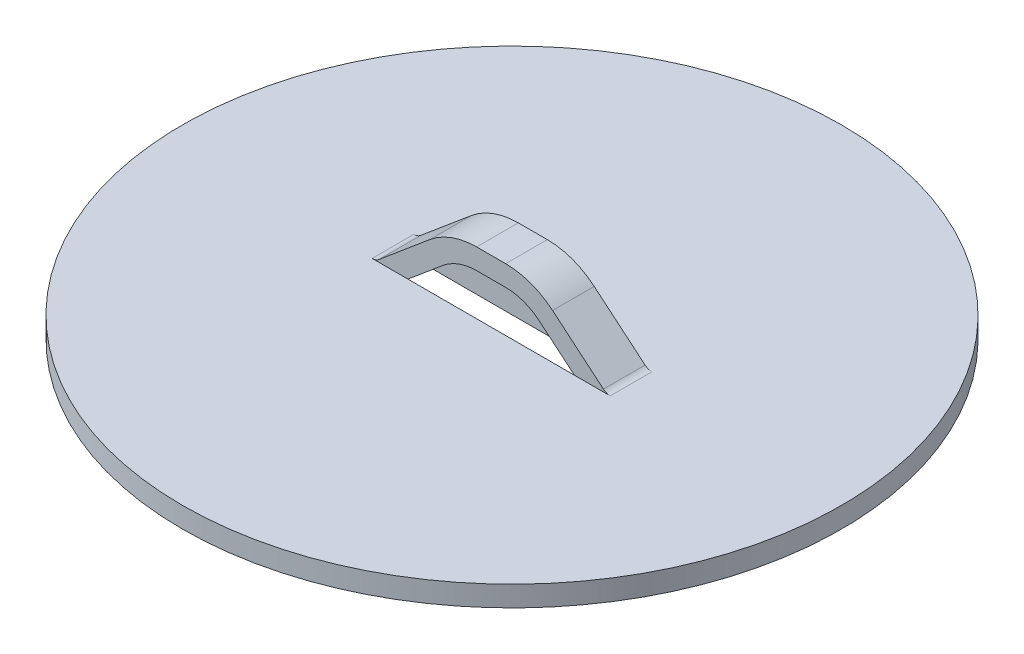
ISO-10303-21;
HEADER;
FILE_DESCRIPTION(('STEP AP214'),'2;1');
FILE_NAME('part.step','',(''),(''),'','','');
FILE_SCHEMA(('AUTOMOTIVE_DESIGN { 1 0 10303 214 1 1 1 1 }'));
ENDSEC;
DATA;
#1=APPLICATION_CONTEXT('core data for automotive mechanical design processes');
#2=APPLICATION_PROTOCOL_DEFINITION('international standard','automotive_design',2000,#1);
#3=PRODUCT_CONTEXT('',#1,'mechanical');
#4=PRODUCT('Part','Part','',(#3));
#5=PRODUCT_RELATED_PRODUCT_CATEGORY('part','',(#4));
#6=PRODUCT_DEFINITION_FORMATION('','',#4);
#7=PRODUCT_DEFINITION_CONTEXT('part definition',#1,'design');
#8=PRODUCT_DEFINITION('design','',#6,#7);
#9=PRODUCT_DEFINITION_SHAPE('','',#8);
#10=(LENGTH_UNIT() NAMED_UNIT(*) SI_UNIT(.MILLI.,.METRE.));
#11=(NAMED_UNIT(*) PLANE_ANGLE_UNIT() SI_UNIT($,.RADIAN.));
#12=(NAMED_UNIT(*) SI_UNIT($,.STERADIAN.) SOLID_ANGLE_UNIT());
#13=UNCERTAINTY_MEASURE_WITH_UNIT(LENGTH_MEASURE(1.E-05),#10,'distance_accuracy_value','');
#14=(GEOMETRIC_REPRESENTATION_CONTEXT(3) GLOBAL_UNCERTAINTY_ASSIGNED_CONTEXT((#13)) GLOBAL_UNIT_ASSIGNED_CONTEXT((#10,
#11,#12)) REPRESENTATION_CONTEXT('',''));
#15=CARTESIAN_POINT('',(0.,0.,0.));
#16=DIRECTION('',(0.,0.,1.));
#17=DIRECTION('',(1.,0.,0.));
#18=AXIS2_PLACEMENT_3D('',#15,#16,#17);
#19=CARTESIAN_POINT('',(-5.73479687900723,0.508,2.0066));
#20=DIRECTION('',(0.,0.,-1.));
#21=DIRECTION('',(-1.,0.,0.));
#22=AXIS2_PLACEMENT_3D('',#19,#20,#21);
#23=PLANE('',#22);
#24=DIRECTION('',(-1.,0.,0.));
#25=VECTOR('',#24,1.);
#26=CARTESIAN_POINT('',(-5.73479687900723,0.,2.0066));
#27=LINE('',#26,#25);
#28=CARTESIAN_POINT('',(-4.00879997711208,0.,2.0066));
#29=VERTEX_POINT('',#28);
#30=CARTESIAN_POINT('',(-5.73479687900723,0.,2.0066));
#31=VERTEX_POINT('',#30);
#32=EDGE_CURVE('E60',#29,#31,#27,.T.);
#33=ORIENTED_EDGE('',*,*,#32,.F.);
#34=DIRECTION('',(0.766044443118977,0.642787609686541,0.));
#35=VECTOR('',#34,1.);
#36=CARTESIAN_POINT('',(-4.77151536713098,-0.639994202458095,2.0066));
#37=LINE('',#36,#35);
#38=CARTESIAN_POINT('',(-2.32136630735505,1.41592496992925,2.0066));
#39=VERTEX_POINT('',#38);
#40=EDGE_CURVE('E267',#29,#39,#37,.T.);
#41=ORIENTED_EDGE('',*,*,#40,.T.);
#42=CARTESIAN_POINT('',(-0.6985,-0.518131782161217,2.0066));
#43=DIRECTION('',(0.,0.,-1.));
#44=DIRECTION('',(-1.,0.,0.));
#45=AXIS2_PLACEMENT_3D('',#42,#43,#44);
#46=CIRCLE('',#45,2.52473178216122);
#47=CARTESIAN_POINT('',(-0.6985,2.0066,2.0066));
#48=VERTEX_POINT('',#47);
#49=EDGE_CURVE('E270',#39,#48,#46,.T.);
#50=ORIENTED_EDGE('',*,*,#49,.T.);
#51=DIRECTION('',(1.,0.,0.));
#52=VECTOR('',#51,1.);
#53=CARTESIAN_POINT('',(-0.6985,2.0066,2.0066));
#54=LINE('',#53,#52);
#55=CARTESIAN_POINT('',(0.6985,2.0066,2.0066));
#56=VERTEX_POINT('',#55);
#57=EDGE_CURVE('E272',#48,#56,#54,.T.);
#58=ORIENTED_EDGE('',*,*,#57,.T.);
#59=CARTESIAN_POINT('',(0.6985,-0.518131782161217,2.0066));
#60=DIRECTION('',(0.,0.,-1.));
#61=DIRECTION('',(-1.,0.,0.));
#62=AXIS2_PLACEMENT_3D('',#59,#60,#61);
#63=CIRCLE('',#62,2.52473178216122);
#64=CARTESIAN_POINT('',(2.32136630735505,1.41592496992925,2.0066));
#65=VERTEX_POINT('',#64);
#66=EDGE_CURVE('E274',#56,#65,#63,.T.);
#67=ORIENTED_EDGE('',*,*,#66,.T.);
#68=DIRECTION('',(0.766044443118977,-0.642787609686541,0.));
#69=VECTOR('',#68,1.);
#70=CARTESIAN_POINT('',(2.32136630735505,1.41592496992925,2.0066));
#71=LINE('',#70,#69);
#72=CARTESIAN_POINT('',(4.00879997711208,0.,2.0066));
#73=VERTEX_POINT('',#72);
#74=EDGE_CURVE('E276',#65,#73,#71,.T.);
#75=ORIENTED_EDGE('',*,*,#74,.T.);
#76=CARTESIAN_POINT('',(5.73479687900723,0.,2.0066));
#77=VERTEX_POINT('',#76);
#78=EDGE_CURVE('E265',#77,#73,#27,.T.);
#79=ORIENTED_EDGE('',*,*,#78,.F.);
#80=CARTESIAN_POINT('',(5.73479687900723,0.508,2.0066));
#81=DIRECTION('',(0.,0.,-1.));
#82=DIRECTION('',(1.,0.,0.));
#83=AXIS2_PLACEMENT_3D('',#80,#81,#82);
#84=CIRCLE('',#83,0.508);
#85=CARTESIAN_POINT('',(5.40826077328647,0.118849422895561,2.0066));
#86=VERTEX_POINT('',#85);
#87=EDGE_CURVE('E279',#77,#86,#84,.T.);
#88=ORIENTED_EDGE('',*,*,#87,.T.);
#89=DIRECTION('',(-0.766044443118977,0.642787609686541,0.));
#90=VECTOR('',#89,1.);
#91=CARTESIAN_POINT('',(2.95811171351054,2.17476859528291,2.0066));
#92=LINE('',#91,#90);
#93=CARTESIAN_POINT('',(2.95811171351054,2.17476859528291,2.0066));
#94=VERTEX_POINT('',#93);
#95=EDGE_CURVE('E281',#86,#94,#92,.T.);
#96=ORIENTED_EDGE('',*,*,#95,.T.);
#97=CARTESIAN_POINT('',(0.6985,-0.518131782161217,2.0066));
#98=DIRECTION('',(0.,0.,1.));
#99=DIRECTION('',(-1.,0.,0.));
#100=AXIS2_PLACEMENT_3D('',#97,#98,#99);
#101=CIRCLE('',#100,3.51533178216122);
#102=CARTESIAN_POINT('',(0.6985,2.9972,2.0066));
#103=VERTEX_POINT('',#102);
#104=EDGE_CURVE('E283',#94,#103,#101,.T.);
#105=ORIENTED_EDGE('',*,*,#104,.T.);
#106=DIRECTION('',(-1.,0.,0.));
#107=VECTOR('',#106,1.);
#108=CARTESIAN_POINT('',(-0.6985,2.9972,2.0066));
#109=LINE('',#108,#107);
#110=CARTESIAN_POINT('',(-0.6985,2.9972,2.0066));
#111=VERTEX_POINT('',#110);
#112=EDGE_CURVE('E285',#103,#111,#109,.T.);
#113=ORIENTED_EDGE('',*,*,#112,.T.);
#114=CARTESIAN_POINT('',(-0.6985,-0.518131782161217,2.0066));
#115=DIRECTION('',(0.,0.,1.));
#116=DIRECTION('',(-1.,0.,0.));
#117=AXIS2_PLACEMENT_3D('',#114,#115,#116);
#118=CIRCLE('',#117,3.51533178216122);
#119=CARTESIAN_POINT('',(-2.95811171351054,2.17476859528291,2.0066));
#120=VERTEX_POINT('',#119);
#121=EDGE_CURVE('E287',#111,#120,#118,.T.);
#122=ORIENTED_EDGE('',*,*,#121,.T.);
#123=DIRECTION('',(-0.766044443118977,-0.642787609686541,0.));
#124=VECTOR('',#123,1.);
#125=CARTESIAN_POINT('',(-5.40826077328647,0.118849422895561,2.0066));
#126=LINE('',#125,#124);
#127=CARTESIAN_POINT('',(-5.40826077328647,0.118849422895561,2.0066));
#128=VERTEX_POINT('',#127);
#129=EDGE_CURVE('E195',#120,#128,#126,.T.);
#130=ORIENTED_EDGE('',*,*,#129,.T.);
#131=CARTESIAN_POINT('',(-5.73479687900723,0.508,2.0066));
#132=DIRECTION('',(0.,0.,-1.));
#133=DIRECTION('',(-1.,0.,0.));
#134=AXIS2_PLACEMENT_3D('',#131,#132,#133);
#135=CIRCLE('',#134,0.508);
#136=EDGE_CURVE('E191',#128,#31,#135,.T.);
#137=ORIENTED_EDGE('',*,*,#136,.T.);
#138=EDGE_LOOP('',(#33,#41,#50,#58,#67,#75,#79,#88,#96,#105,#113,#122,#130,#137));
#139=FACE_BOUND('',#138,.T.);
#140=ADVANCED_FACE('F37',(#139),#23,.F.);
#141=CARTESIAN_POINT('',(-5.73479687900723,0.508,0.));
#142=DIRECTION('',(0.,0.,-1.));
#143=DIRECTION('',(-1.,0.,0.));
#144=AXIS2_PLACEMENT_3D('',#141,#142,#143);
#145=PLANE('',#144);
#146=DIRECTION('',(0.766044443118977,0.642787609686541,0.));
#147=VECTOR('',#146,1.);
#148=CARTESIAN_POINT('',(-4.77151536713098,-0.639994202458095,0.));
#149=LINE('',#148,#147);
#150=CARTESIAN_POINT('',(-4.00879997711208,0.,0.));
#151=VERTEX_POINT('',#150);
#152=CARTESIAN_POINT('',(-2.32136630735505,1.41592496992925,0.));
#153=VERTEX_POINT('',#152);
#154=EDGE_CURVE('E170',#151,#153,#149,.T.);
#155=ORIENTED_EDGE('',*,*,#154,.F.);
#156=DIRECTION('',(1.,0.,0.));
#157=VECTOR('',#156,1.);
#158=CARTESIAN_POINT('',(-5.73479687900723,0.,0.));
#159=LINE('',#158,#157);
#160=CARTESIAN_POINT('',(-5.73479687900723,0.,0.));
#161=VERTEX_POINT('',#160);
#162=EDGE_CURVE('E164',#161,#151,#159,.T.);
#163=ORIENTED_EDGE('',*,*,#162,.F.);
#164=CARTESIAN_POINT('',(-5.73479687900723,0.508,0.));
#165=DIRECTION('',(0.,0.,-1.));
#166=DIRECTION('',(-1.,0.,0.));
#167=AXIS2_PLACEMENT_3D('',#164,#165,#166);
#168=CIRCLE('',#167,0.508);
#169=CARTESIAN_POINT('',(-5.40826077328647,0.118849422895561,0.));
#170=VERTEX_POINT('',#169);
#171=EDGE_CURVE('E168',#170,#161,#168,.T.);
#172=ORIENTED_EDGE('',*,*,#171,.F.);
#173=DIRECTION('',(-0.766044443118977,-0.642787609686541,0.));
#174=VECTOR('',#173,1.);
#175=CARTESIAN_POINT('',(-5.40826077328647,0.118849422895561,0.));
#176=LINE('',#175,#174);
#177=CARTESIAN_POINT('',(-2.95811171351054,2.17476859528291,0.));
#178=VERTEX_POINT('',#177);
#179=EDGE_CURVE('E186',#178,#170,#176,.T.);
#180=ORIENTED_EDGE('',*,*,#179,.F.);
#181=CARTESIAN_POINT('',(-0.6985,-0.518131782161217,0.));
#182=DIRECTION('',(0.,0.,1.));
#183=DIRECTION('',(-1.,0.,0.));
#184=AXIS2_PLACEMENT_3D('',#181,#182,#183);
#185=CIRCLE('',#184,3.51533178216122);
#186=CARTESIAN_POINT('',(-0.6985,2.9972,0.));
#187=VERTEX_POINT('',#186);
#188=EDGE_CURVE('E314',#187,#178,#185,.T.);
#189=ORIENTED_EDGE('',*,*,#188,.F.);
#190=DIRECTION('',(-1.,0.,0.));
#191=VECTOR('',#190,1.);
#192=CARTESIAN_POINT('',(-0.6985,2.9972,0.));
#193=LINE('',#192,#191);
#194=CARTESIAN_POINT('',(0.6985,2.9972,0.));
#195=VERTEX_POINT('',#194);
#196=EDGE_CURVE('E312',#195,#187,#193,.T.);
#197=ORIENTED_EDGE('',*,*,#196,.F.);
#198=CARTESIAN_POINT('',(0.6985,-0.518131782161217,0.));
#199=DIRECTION('',(0.,0.,1.));
#200=DIRECTION('',(-1.,0.,0.));
#201=AXIS2_PLACEMENT_3D('',#198,#199,#200);
#202=CIRCLE('',#201,3.51533178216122);
#203=CARTESIAN_POINT('',(2.95811171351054,2.17476859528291,0.));
#204=VERTEX_POINT('',#203);
#205=EDGE_CURVE('E310',#204,#195,#202,.T.);
#206=ORIENTED_EDGE('',*,*,#205,.F.);
#207=DIRECTION('',(-0.766044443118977,0.642787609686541,0.));
#208=VECTOR('',#207,1.);
#209=CARTESIAN_POINT('',(2.95811171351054,2.17476859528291,0.));
#210=LINE('',#209,#208);
#211=CARTESIAN_POINT('',(5.40826077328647,0.118849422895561,0.));
#212=VERTEX_POINT('',#211);
#213=EDGE_CURVE('E308',#212,#204,#210,.T.);
#214=ORIENTED_EDGE('',*,*,#213,.F.);
#215=CARTESIAN_POINT('',(5.73479687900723,0.508,0.));
#216=DIRECTION('',(0.,0.,-1.));
#217=DIRECTION('',(1.,0.,0.));
#218=AXIS2_PLACEMENT_3D('',#215,#216,#217);
#219=CIRCLE('',#218,0.508);
#220=CARTESIAN_POINT('',(5.73479687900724,0.,0.));
#221=VERTEX_POINT('',#220);
#222=EDGE_CURVE('E306',#221,#212,#219,.T.);
#223=ORIENTED_EDGE('',*,*,#222,.F.);
#224=DIRECTION('',(-1.,0.,0.));
#225=VECTOR('',#224,1.);
#226=CARTESIAN_POINT('',(-5.73479687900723,0.,0.));
#227=LINE('',#226,#225);
#228=CARTESIAN_POINT('',(4.00879997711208,0.,0.));
#229=VERTEX_POINT('',#228);
#230=EDGE_CURVE('E11',#221,#229,#227,.T.);
#231=ORIENTED_EDGE('',*,*,#230,.T.);
#232=DIRECTION('',(0.766044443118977,-0.642787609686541,0.));
#233=VECTOR('',#232,1.);
#234=CARTESIAN_POINT('',(2.32136630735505,1.41592496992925,0.));
#235=LINE('',#234,#233);
#236=CARTESIAN_POINT('',(2.32136630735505,1.41592496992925,0.));
#237=VERTEX_POINT('',#236);
#238=EDGE_CURVE('E300',#237,#229,#235,.T.);
#239=ORIENTED_EDGE('',*,*,#238,.F.);
#240=CARTESIAN_POINT('',(0.6985,-0.518131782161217,0.));
#241=DIRECTION('',(0.,0.,-1.));
#242=DIRECTION('',(-1.,0.,0.));
#243=AXIS2_PLACEMENT_3D('',#240,#241,#242);
#244=CIRCLE('',#243,2.52473178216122);
#245=CARTESIAN_POINT('',(0.6985,2.0066,0.));
#246=VERTEX_POINT('',#245);
#247=EDGE_CURVE('E297',#246,#237,#244,.T.);
#248=ORIENTED_EDGE('',*,*,#247,.F.);
#249=DIRECTION('',(1.,0.,0.));
#250=VECTOR('',#249,1.);
#251=CARTESIAN_POINT('',(-0.6985,2.0066,0.));
#252=LINE('',#251,#250);
#253=CARTESIAN_POINT('',(-0.6985,2.0066,0.));
#254=VERTEX_POINT('',#253);
#255=EDGE_CURVE('E295',#254,#246,#252,.T.);
#256=ORIENTED_EDGE('',*,*,#255,.F.);
#257=CARTESIAN_POINT('',(-0.6985,-0.518131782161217,0.));
#258=DIRECTION('',(0.,0.,-1.));
#259=DIRECTION('',(-1.,0.,0.));
#260=AXIS2_PLACEMENT_3D('',#257,#258,#259);
#261=CIRCLE('',#260,2.52473178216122);
#262=EDGE_CURVE('E293',#153,#254,#261,.T.);
#263=ORIENTED_EDGE('',*,*,#262,.F.);
#264=EDGE_LOOP('',(#155,#163,#172,#180,#189,#197,#206,#214,#223,#231,#239,#248,#256,#263));
#265=FACE_BOUND('',#264,.T.);
#266=ADVANCED_FACE('F166',(#265),#145,.T.);
#267=CARTESIAN_POINT('',(-5.73479687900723,0.508,2.0066));
#268=DIRECTION('',(0.,0.,-1.));
#269=DIRECTION('',(-1.,0.,0.));
#270=AXIS2_PLACEMENT_3D('',#267,#268,#269);
#271=CYLINDRICAL_SURFACE('',#270,1.4986);
#272=CARTESIAN_POINT('',(-5.73479687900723,0.508,0.));
#273=DIRECTION('',(0.,0.,1.));
#274=DIRECTION('',(-1.,0.,0.));
#275=AXIS2_PLACEMENT_3D('',#272,#273,#274);
#276=CIRCLE('',#275,1.4986);
#277=CARTESIAN_POINT('',(-5.73479687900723,-0.9906,0.));
#278=VERTEX_POINT('',#277);
#279=CARTESIAN_POINT('',(-4.77151536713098,-0.639994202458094,0.));
#280=VERTEX_POINT('',#279);
#281=EDGE_CURVE('E241',#278,#280,#276,.T.);
#282=ORIENTED_EDGE('',*,*,#281,.T.);
#283=DIRECTION('',(0.,0.,-1.));
#284=VECTOR('',#283,1.);
#285=CARTESIAN_POINT('',(-4.77151536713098,-0.639994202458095,2.0066));
#286=LINE('',#285,#284);
#287=CARTESIAN_POINT('',(-4.77151536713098,-0.639994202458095,2.0066));
#288=VERTEX_POINT('',#287);
#289=EDGE_CURVE('E234',#288,#280,#286,.T.);
#290=ORIENTED_EDGE('',*,*,#289,.F.);
#291=CARTESIAN_POINT('',(-5.73479687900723,0.508,2.0066));
#292=DIRECTION('',(0.,0.,1.));
#293=DIRECTION('',(-1.,0.,0.));
#294=AXIS2_PLACEMENT_3D('',#291,#292,#293);
#295=CIRCLE('',#294,1.4986);
#296=CARTESIAN_POINT('',(-5.73479687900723,-0.9906,2.0066));
#297=VERTEX_POINT('',#296);
#298=EDGE_CURVE('E185',#297,#288,#295,.T.);
#299=ORIENTED_EDGE('',*,*,#298,.F.);
#300=DIRECTION('',(0.,0.,-1.));
#301=VECTOR('',#300,1.);
#302=CARTESIAN_POINT('',(-5.73479687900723,-0.9906,2.0066));
#303=LINE('',#302,#301);
#304=EDGE_CURVE('E45',#297,#278,#303,.T.);
#305=ORIENTED_EDGE('',*,*,#304,.T.);
#306=EDGE_LOOP('',(#282,#290,#299,#305));
#307=FACE_BOUND('',#306,.T.);
#308=ADVANCED_FACE('F39',(#307),#271,.T.);
#309=CARTESIAN_POINT('',(-4.77151536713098,-0.639994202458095,2.0066));
#310=DIRECTION('',(-0.642787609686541,0.766044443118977,0.));
#311=DIRECTION('',(-0.766044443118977,-0.642787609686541,0.));
#312=AXIS2_PLACEMENT_3D('',#309,#310,#311);
#313=PLANE('',#312);
#314=EDGE_CURVE('E291',#280,#151,#149,.T.);
#315=ORIENTED_EDGE('',*,*,#314,.T.);
#316=ORIENTED_EDGE('',*,*,#154,.T.);
#317=DIRECTION('',(0.,0.,-1.));
#318=VECTOR('',#317,1.);
#319=CARTESIAN_POINT('',(-2.32136630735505,1.41592496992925,2.0066));
#320=LINE('',#319,#318);
#321=EDGE_CURVE('E231',#39,#153,#320,.T.);
#322=ORIENTED_EDGE('',*,*,#321,.F.);
#323=ORIENTED_EDGE('',*,*,#40,.F.);
#324=EDGE_CURVE('E268',#288,#29,#37,.T.);
#325=ORIENTED_EDGE('',*,*,#324,.F.);
#326=ORIENTED_EDGE('',*,*,#289,.T.);
#327=EDGE_LOOP('',(#315,#316,#322,#323,#325,#326));
#328=FACE_BOUND('',#327,.T.);
#329=ADVANCED_FACE('F363',(#328),#313,.F.);
#330=CARTESIAN_POINT('',(-0.6985,-0.518131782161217,2.0066));
#331=DIRECTION('',(0.,0.,-1.));
#332=DIRECTION('',(-1.,0.,0.));
#333=AXIS2_PLACEMENT_3D('',#330,#331,#332);
#334=CYLINDRICAL_SURFACE('',#333,2.52473178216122);
#335=ORIENTED_EDGE('',*,*,#262,.T.);
#336=DIRECTION('',(0.,0.,-1.));
#337=VECTOR('',#336,1.);
#338=CARTESIAN_POINT('',(-0.6985,2.0066,2.0066));
#339=LINE('',#338,#337);
#340=EDGE_CURVE('E228',#48,#254,#339,.T.);
#341=ORIENTED_EDGE('',*,*,#340,.F.);
#342=ORIENTED_EDGE('',*,*,#49,.F.);
#343=ORIENTED_EDGE('',*,*,#321,.T.);
#344=EDGE_LOOP('',(#335,#341,#342,#343));
#345=FACE_BOUND('',#344,.T.);
#346=ADVANCED_FACE('F360',(#345),#334,.F.);
#347=CARTESIAN_POINT('',(-0.6985,2.0066,2.0066));
#348=DIRECTION('',(0.,1.,0.));
#349=DIRECTION('',(0.,0.,1.));
#350=AXIS2_PLACEMENT_3D('',#347,#348,#349);
#351=PLANE('',#350);
#352=ORIENTED_EDGE('',*,*,#255,.T.);
#353=DIRECTION('',(0.,0.,-1.));
#354=VECTOR('',#353,1.);
#355=CARTESIAN_POINT('',(0.6985,2.0066,2.0066));
#356=LINE('',#355,#354);
#357=EDGE_CURVE('E225',#56,#246,#356,.T.);
#358=ORIENTED_EDGE('',*,*,#357,.F.);
#359=ORIENTED_EDGE('',*,*,#57,.F.);
#360=ORIENTED_EDGE('',*,*,#340,.T.);
#361=EDGE_LOOP('',(#352,#358,#359,#360));
#362=FACE_BOUND('',#361,.T.);
#363=ADVANCED_FACE('F355',(#362),#351,.F.);
#364=CARTESIAN_POINT('',(0.6985,-0.518131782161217,2.0066));
#365=DIRECTION('',(0.,0.,-1.));
#366=DIRECTION('',(-1.,0.,0.));
#367=AXIS2_PLACEMENT_3D('',#364,#365,#366);
#368=CYLINDRICAL_SURFACE('',#367,2.52473178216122);
#369=ORIENTED_EDGE('',*,*,#247,.T.);
#370=DIRECTION('',(0.,0.,-1.));
#371=VECTOR('',#370,1.);
#372=CARTESIAN_POINT('',(2.32136630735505,1.41592496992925,2.0066));
#373=LINE('',#372,#371);
#374=EDGE_CURVE('E222',#65,#237,#373,.T.);
#375=ORIENTED_EDGE('',*,*,#374,.F.);
#376=ORIENTED_EDGE('',*,*,#66,.F.);
#377=ORIENTED_EDGE('',*,*,#357,.T.);
#378=EDGE_LOOP('',(#369,#375,#376,#377));
#379=FACE_BOUND('',#378,.T.);
#380=ADVANCED_FACE('F351',(#379),#368,.F.);
#381=CARTESIAN_POINT('',(2.32136630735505,1.41592496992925,2.0066));
#382=DIRECTION('',(0.642787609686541,0.766044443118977,0.));
#383=DIRECTION('',(-0.766044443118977,0.642787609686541,0.));
#384=AXIS2_PLACEMENT_3D('',#381,#382,#383);
#385=PLANE('',#384);
#386=ORIENTED_EDGE('',*,*,#238,.T.);
#387=CARTESIAN_POINT('',(4.77151536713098,-0.639994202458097,0.));
#388=VERTEX_POINT('',#387);
#389=EDGE_CURVE('E299',#229,#388,#235,.T.);
#390=ORIENTED_EDGE('',*,*,#389,.T.);
#391=DIRECTION('',(0.,0.,-1.));
#392=VECTOR('',#391,1.);
#393=CARTESIAN_POINT('',(4.77151536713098,-0.639994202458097,2.0066));
#394=LINE('',#393,#392);
#395=CARTESIAN_POINT('',(4.77151536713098,-0.639994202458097,2.0066));
#396=VERTEX_POINT('',#395);
#397=EDGE_CURVE('E219',#396,#388,#394,.T.);
#398=ORIENTED_EDGE('',*,*,#397,.F.);
#399=EDGE_CURVE('E52',#73,#396,#71,.T.);
#400=ORIENTED_EDGE('',*,*,#399,.F.);
#401=ORIENTED_EDGE('',*,*,#74,.F.);
#402=ORIENTED_EDGE('',*,*,#374,.T.);
#403=EDGE_LOOP('',(#386,#390,#398,#400,#401,#402));
#404=FACE_BOUND('',#403,.T.);
#405=ADVANCED_FACE('F347',(#404),#385,.F.);
#406=CARTESIAN_POINT('',(5.73479687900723,0.508,2.0066));
#407=DIRECTION('',(0.,0.,-1.));
#408=DIRECTION('',(-1.,0.,0.));
#409=AXIS2_PLACEMENT_3D('',#406,#407,#408);
#410=CYLINDRICAL_SURFACE('',#409,1.4986);
#411=CARTESIAN_POINT('',(5.73479687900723,0.508,0.));
#412=DIRECTION('',(0.,0.,1.));
#413=DIRECTION('',(1.,0.,0.));
#414=AXIS2_PLACEMENT_3D('',#411,#412,#413);
#415=CIRCLE('',#414,1.4986);
#416=CARTESIAN_POINT('',(5.73479687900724,-0.9906,0.));
#417=VERTEX_POINT('',#416);
#418=EDGE_CURVE('E303',#388,#417,#415,.T.);
#419=ORIENTED_EDGE('',*,*,#418,.T.);
#420=DIRECTION('',(0.,0.,-1.));
#421=VECTOR('',#420,1.);
#422=CARTESIAN_POINT('',(5.73479687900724,-0.9906,2.0066));
#423=LINE('',#422,#421);
#424=CARTESIAN_POINT('',(5.73479687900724,-0.9906,2.0066));
#425=VERTEX_POINT('',#424);
#426=EDGE_CURVE('E216',#425,#417,#423,.T.);
#427=ORIENTED_EDGE('',*,*,#426,.F.);
#428=CARTESIAN_POINT('',(5.73479687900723,0.508,2.0066));
#429=DIRECTION('',(0.,0.,1.));
#430=DIRECTION('',(1.,0.,0.));
#431=AXIS2_PLACEMENT_3D('',#428,#429,#430);
#432=CIRCLE('',#431,1.4986);
#433=EDGE_CURVE('E254',#396,#425,#432,.T.);
#434=ORIENTED_EDGE('',*,*,#433,.F.);
#435=ORIENTED_EDGE('',*,*,#397,.T.);
#436=EDGE_LOOP('',(#419,#427,#434,#435));
#437=FACE_BOUND('',#436,.T.);
#438=ADVANCED_FACE('F368',(#437),#410,.T.);
#439=CARTESIAN_POINT('',(5.73479687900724,-0.9906,2.0066));
#440=DIRECTION('',(0.,1.,0.));
#441=DIRECTION('',(0.,0.,1.));
#442=AXIS2_PLACEMENT_3D('',#439,#440,#441);
#443=PLANE('',#442);
#444=CARTESIAN_POINT('',(0.,-0.9906,1.0033));
#445=DIRECTION('',(0.,-1.,0.));
#446=DIRECTION('',(0.,0.,-1.));
#447=AXIS2_PLACEMENT_3D('',#444,#445,#446);
#448=CIRCLE('',#447,15.875);
#449=CARTESIAN_POINT('',(0.,-0.9906,-14.8717));
#450=VERTEX_POINT('',#449);
#451=EDGE_CURVE('E262',#450,#450,#448,.T.);
#452=ORIENTED_EDGE('',*,*,#451,.T.);
#453=EDGE_LOOP('',(#452));
#454=FACE_BOUND('',#453,.T.);
#455=DIRECTION('',(-1.,0.,0.));
#456=VECTOR('',#455,1.);
#457=CARTESIAN_POINT('',(-5.73479687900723,-0.9906,2.0066));
#458=LINE('',#457,#456);
#459=EDGE_CURVE('E247',#425,#297,#458,.T.);
#460=ORIENTED_EDGE('',*,*,#459,.F.);
#461=ORIENTED_EDGE('',*,*,#426,.T.);
#462=DIRECTION('',(1.,0.,0.));
#463=VECTOR('',#462,1.);
#464=CARTESIAN_POINT('',(-5.73479687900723,-0.9906,0.));
#465=LINE('',#464,#463);
#466=EDGE_CURVE('E248',#278,#417,#465,.T.);
#467=ORIENTED_EDGE('',*,*,#466,.F.);
#468=ORIENTED_EDGE('',*,*,#304,.F.);
#469=EDGE_LOOP('',(#460,#461,#467,#468));
#470=FACE_BOUND('',#469,.T.);
#471=ADVANCED_FACE('F246',(#454,#470),#443,.F.);
#472=CARTESIAN_POINT('',(5.73479687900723,0.508,2.0066));
#473=DIRECTION('',(0.,0.,-1.));
#474=DIRECTION('',(-1.,0.,0.));
#475=AXIS2_PLACEMENT_3D('',#472,#473,#474);
#476=CYLINDRICAL_SURFACE('',#475,0.508);
#477=ORIENTED_EDGE('',*,*,#222,.T.);
#478=DIRECTION('',(0.,0.,-1.));
#479=VECTOR('',#478,1.);
#480=CARTESIAN_POINT('',(5.40826077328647,0.118849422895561,2.0066));
#481=LINE('',#480,#479);
#482=EDGE_CURVE('E210',#86,#212,#481,.T.);
#483=ORIENTED_EDGE('',*,*,#482,.F.);
#484=ORIENTED_EDGE('',*,*,#87,.F.);
#485=DIRECTION('',(0.,0.,-1.));
#486=VECTOR('',#485,1.);
#487=CARTESIAN_POINT('',(5.73479687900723,0.,2.0066));
#488=LINE('',#487,#486);
#489=EDGE_CURVE('E213',#77,#221,#488,.T.);
#490=ORIENTED_EDGE('',*,*,#489,.T.);
#491=EDGE_LOOP('',(#477,#483,#484,#490));
#492=FACE_BOUND('',#491,.T.);
#493=ADVANCED_FACE('F342',(#492),#476,.F.);
#494=CARTESIAN_POINT('',(2.95811171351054,2.17476859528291,2.0066));
#495=DIRECTION('',(-0.642787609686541,-0.766044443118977,0.));
#496=DIRECTION('',(0.766044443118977,-0.642787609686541,0.));
#497=AXIS2_PLACEMENT_3D('',#494,#495,#496);
#498=PLANE('',#497);
#499=ORIENTED_EDGE('',*,*,#213,.T.);
#500=DIRECTION('',(0.,0.,-1.));
#501=VECTOR('',#500,1.);
#502=CARTESIAN_POINT('',(2.95811171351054,2.17476859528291,2.0066));
#503=LINE('',#502,#501);
#504=EDGE_CURVE('E207',#94,#204,#503,.T.);
#505=ORIENTED_EDGE('',*,*,#504,.F.);
#506=ORIENTED_EDGE('',*,*,#95,.F.);
#507=ORIENTED_EDGE('',*,*,#482,.T.);
#508=EDGE_LOOP('',(#499,#505,#506,#507));
#509=FACE_BOUND('',#508,.T.);
#510=ADVANCED_FACE('F337',(#509),#498,.F.);
#511=CARTESIAN_POINT('',(0.6985,-0.518131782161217,2.0066));
#512=DIRECTION('',(0.,0.,-1.));
#513=DIRECTION('',(-1.,0.,0.));
#514=AXIS2_PLACEMENT_3D('',#511,#512,#513);
#515=CYLINDRICAL_SURFACE('',#514,3.51533178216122);
#516=ORIENTED_EDGE('',*,*,#205,.T.);
#517=DIRECTION('',(0.,0.,-1.));
#518=VECTOR('',#517,1.);
#519=CARTESIAN_POINT('',(0.6985,2.9972,2.0066));
#520=LINE('',#519,#518);
#521=EDGE_CURVE('E204',#103,#195,#520,.T.);
#522=ORIENTED_EDGE('',*,*,#521,.F.);
#523=ORIENTED_EDGE('',*,*,#104,.F.);
#524=ORIENTED_EDGE('',*,*,#504,.T.);
#525=EDGE_LOOP('',(#516,#522,#523,#524));
#526=FACE_BOUND('',#525,.T.);
#527=ADVANCED_FACE('F332',(#526),#515,.T.);
#528=CARTESIAN_POINT('',(-0.6985,2.9972,2.0066));
#529=DIRECTION('',(0.,-1.,0.));
#530=DIRECTION('',(0.,0.,-1.));
#531=AXIS2_PLACEMENT_3D('',#528,#529,#530);
#532=PLANE('',#531);
#533=ORIENTED_EDGE('',*,*,#196,.T.);
#534=DIRECTION('',(0.,0.,-1.));
#535=VECTOR('',#534,1.);
#536=CARTESIAN_POINT('',(-0.6985,2.9972,2.0066));
#537=LINE('',#536,#535);
#538=EDGE_CURVE('E201',#111,#187,#537,.T.);
#539=ORIENTED_EDGE('',*,*,#538,.F.);
#540=ORIENTED_EDGE('',*,*,#112,.F.);
#541=ORIENTED_EDGE('',*,*,#521,.T.);
#542=EDGE_LOOP('',(#533,#539,#540,#541));
#543=FACE_BOUND('',#542,.T.);
#544=ADVANCED_FACE('F328',(#543),#532,.F.);
#545=CARTESIAN_POINT('',(-0.6985,-0.518131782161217,2.0066));
#546=DIRECTION('',(0.,0.,-1.));
#547=DIRECTION('',(-1.,0.,0.));
#548=AXIS2_PLACEMENT_3D('',#545,#546,#547);
#549=CYLINDRICAL_SURFACE('',#548,3.51533178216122);
#550=ORIENTED_EDGE('',*,*,#188,.T.);
#551=DIRECTION('',(0.,0.,-1.));
#552=VECTOR('',#551,1.);
#553=CARTESIAN_POINT('',(-2.95811171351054,2.17476859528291,2.0066));
#554=LINE('',#553,#552);
#555=EDGE_CURVE('E193',#120,#178,#554,.T.);
#556=ORIENTED_EDGE('',*,*,#555,.F.);
#557=ORIENTED_EDGE('',*,*,#121,.F.);
#558=ORIENTED_EDGE('',*,*,#538,.T.);
#559=EDGE_LOOP('',(#550,#556,#557,#558));
#560=FACE_BOUND('',#559,.T.);
#561=ADVANCED_FACE('F323',(#560),#549,.T.);
#562=CARTESIAN_POINT('',(-5.40826077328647,0.118849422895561,2.0066));
#563=DIRECTION('',(0.642787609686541,-0.766044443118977,0.));
#564=DIRECTION('',(0.766044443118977,0.642787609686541,0.));
#565=AXIS2_PLACEMENT_3D('',#562,#563,#564);
#566=PLANE('',#565);
#567=ORIENTED_EDGE('',*,*,#179,.T.);
#568=DIRECTION('',(0.,0.,-1.));
#569=VECTOR('',#568,1.);
#570=CARTESIAN_POINT('',(-5.40826077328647,0.118849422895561,2.0066));
#571=LINE('',#570,#569);
#572=EDGE_CURVE('E184',#128,#170,#571,.T.);
#573=ORIENTED_EDGE('',*,*,#572,.F.);
#574=ORIENTED_EDGE('',*,*,#129,.F.);
#575=ORIENTED_EDGE('',*,*,#555,.T.);
#576=EDGE_LOOP('',(#567,#573,#574,#575));
#577=FACE_BOUND('',#576,.T.);
#578=ADVANCED_FACE('F316',(#577),#566,.F.);
#579=CARTESIAN_POINT('',(-5.73479687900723,0.508,2.0066));
#580=DIRECTION('',(0.,0.,-1.));
#581=DIRECTION('',(-1.,0.,0.));
#582=AXIS2_PLACEMENT_3D('',#579,#580,#581);
#583=CYLINDRICAL_SURFACE('',#582,0.508);
#584=ORIENTED_EDGE('',*,*,#171,.T.);
#585=DIRECTION('',(0.,0.,-1.));
#586=VECTOR('',#585,1.);
#587=CARTESIAN_POINT('',(-5.73479687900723,0.,2.0066));
#588=LINE('',#587,#586);
#589=EDGE_CURVE('E182',#31,#161,#588,.T.);
#590=ORIENTED_EDGE('',*,*,#589,.F.);
#591=ORIENTED_EDGE('',*,*,#136,.F.);
#592=ORIENTED_EDGE('',*,*,#572,.T.);
#593=EDGE_LOOP('',(#584,#590,#591,#592));
#594=FACE_BOUND('',#593,.T.);
#595=ADVANCED_FACE('F180',(#594),#583,.F.);
#596=CARTESIAN_POINT('',(-15.875,0.,2.0066));
#597=DIRECTION('',(0.,-1.,0.));
#598=DIRECTION('',(0.,0.,-1.));
#599=AXIS2_PLACEMENT_3D('',#596,#597,#598);
#600=PLANE('',#599);
#601=CARTESIAN_POINT('',(0.,0.,1.0033));
#602=DIRECTION('',(0.,-1.,0.));
#603=DIRECTION('',(0.,0.,-1.));
#604=AXIS2_PLACEMENT_3D('',#601,#602,#603);
#605=CIRCLE('',#604,15.875);
#606=CARTESIAN_POINT('',(0.,0.,-14.8717));
#607=VERTEX_POINT('',#606);
#608=EDGE_CURVE('E259',#607,#607,#605,.T.);
#609=ORIENTED_EDGE('',*,*,#608,.F.);
#610=EDGE_LOOP('',(#609));
#611=FACE_BOUND('',#610,.T.);
#612=ORIENTED_EDGE('',*,*,#489,.F.);
#613=ORIENTED_EDGE('',*,*,#78,.T.);
#614=EDGE_CURVE('E370',#73,#29,#27,.T.);
#615=ORIENTED_EDGE('',*,*,#614,.T.);
#616=ORIENTED_EDGE('',*,*,#32,.T.);
#617=ORIENTED_EDGE('',*,*,#589,.T.);
#618=ORIENTED_EDGE('',*,*,#162,.T.);
#619=EDGE_CURVE('E175',#151,#229,#159,.T.);
#620=ORIENTED_EDGE('',*,*,#619,.T.);
#621=ORIENTED_EDGE('',*,*,#230,.F.);
#622=EDGE_LOOP('',(#612,#613,#615,#616,#617,#618,#620,#621));
#623=FACE_BOUND('',#622,.T.);
#624=ADVANCED_FACE('F189',(#611,#623),#600,.F.);
#625=CARTESIAN_POINT('',(-5.73479687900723,0.,0.));
#626=DIRECTION('',(0.,0.,-1.));
#627=DIRECTION('',(-1.,0.,0.));
#628=AXIS2_PLACEMENT_3D('',#625,#626,#627);
#629=PLANE('',#628);
#630=ORIENTED_EDGE('',*,*,#314,.F.);
#631=ORIENTED_EDGE('',*,*,#281,.F.);
#632=ORIENTED_EDGE('',*,*,#466,.T.);
#633=ORIENTED_EDGE('',*,*,#418,.F.);
#634=ORIENTED_EDGE('',*,*,#389,.F.);
#635=ORIENTED_EDGE('',*,*,#619,.F.);
#636=EDGE_LOOP('',(#630,#631,#632,#633,#634,#635));
#637=FACE_BOUND('',#636,.T.);
#638=ADVANCED_FACE('F366',(#637),#629,.F.);
#639=CARTESIAN_POINT('',(-5.73479687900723,0.,2.0066));
#640=DIRECTION('',(0.,0.,1.));
#641=DIRECTION('',(1.,0.,0.));
#642=AXIS2_PLACEMENT_3D('',#639,#640,#641);
#643=PLANE('',#642);
#644=ORIENTED_EDGE('',*,*,#459,.T.);
#645=ORIENTED_EDGE('',*,*,#298,.T.);
#646=ORIENTED_EDGE('',*,*,#324,.T.);
#647=ORIENTED_EDGE('',*,*,#614,.F.);
#648=ORIENTED_EDGE('',*,*,#399,.T.);
#649=ORIENTED_EDGE('',*,*,#433,.T.);
#650=EDGE_LOOP('',(#644,#645,#646,#647,#648,#649));
#651=FACE_BOUND('',#650,.T.);
#652=ADVANCED_FACE('F251',(#651),#643,.F.);
#653=CARTESIAN_POINT('',(0.,0.,1.0033));
#654=DIRECTION('',(0.,-1.,0.));
#655=DIRECTION('',(0.,0.,-1.));
#656=AXIS2_PLACEMENT_3D('',#653,#654,#655);
#657=CYLINDRICAL_SURFACE('',#656,15.875);
#658=ORIENTED_EDGE('',*,*,#608,.T.);
#659=EDGE_LOOP('',(#658));
#660=FACE_BOUND('',#659,.T.);
#661=ORIENTED_EDGE('',*,*,#451,.F.);
#662=EDGE_LOOP('',(#661));
#663=FACE_BOUND('',#662,.T.);
#664=ADVANCED_FACE('F387',(#660,#663),#657,.T.);
#665=CLOSED_SHELL('',(#140,#266,#308,#329,#346,#363,#380,#405,#438,#471,#493,#510,#527,#544,
#561,#578,#595,#624,#638,#652,#664));
#666=MANIFOLD_SOLID_BREP('B2',#665);
#667=ADVANCED_BREP_SHAPE_REPRESENTATION('',(#18,#666),#14);
#668=SHAPE_DEFINITION_REPRESENTATION(#9,#667);
ENDSEC;
END-ISO-10303-21;
